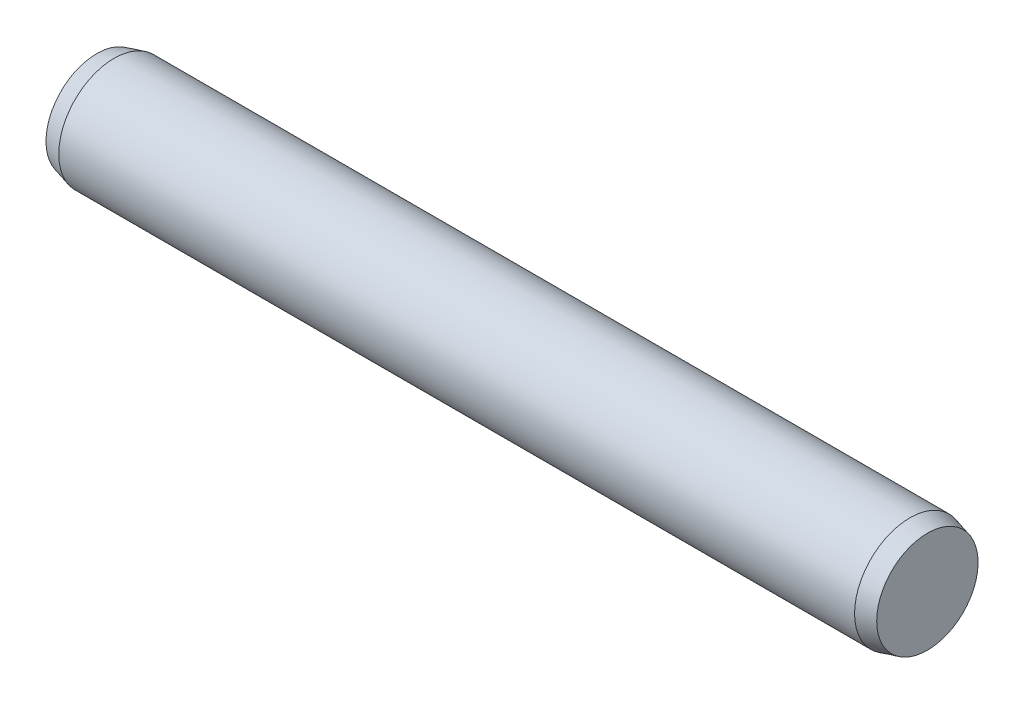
from build123d import *


with BuildPart() as part:
    # Sketch1 → Base-Revolve (revolve)
    with BuildSketch(Plane.XY, mode=Mode.PRIVATE) as base_revolve_sk:
        Polygon((0, 0), (30, 0), (30, 1.831192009), (29.37, 2), (0.63, 2), (0, 1.831192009), align=None)
    revolve(base_revolve_sk.sketch.rotate(Axis((-6.35, 0, 0), (1, 0, 0)), 90), axis=Axis((-6.35, 0, 0), (1, 0, 0)))


solid = part.part
